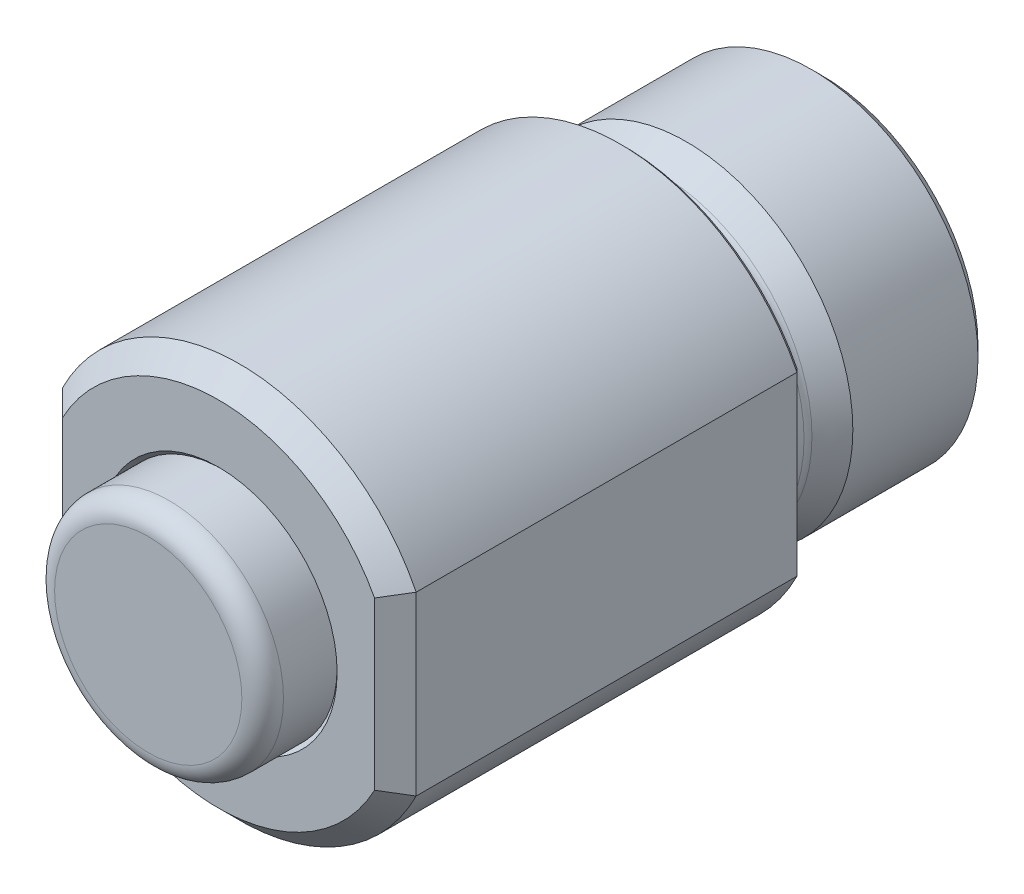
ISO-10303-21;
HEADER;
FILE_DESCRIPTION(('STEP AP214'),'2;1');
FILE_NAME('part.step','',(''),(''),'','','');
FILE_SCHEMA(('AUTOMOTIVE_DESIGN { 1 0 10303 214 1 1 1 1 }'));
ENDSEC;
DATA;
#1=APPLICATION_CONTEXT('core data for automotive mechanical design processes');
#2=APPLICATION_PROTOCOL_DEFINITION('international standard','automotive_design',2000,#1);
#3=PRODUCT_CONTEXT('',#1,'mechanical');
#4=PRODUCT('Part','Part','',(#3));
#5=PRODUCT_RELATED_PRODUCT_CATEGORY('part','',(#4));
#6=PRODUCT_DEFINITION_FORMATION('','',#4);
#7=PRODUCT_DEFINITION_CONTEXT('part definition',#1,'design');
#8=PRODUCT_DEFINITION('design','',#6,#7);
#9=PRODUCT_DEFINITION_SHAPE('','',#8);
#10=(LENGTH_UNIT() NAMED_UNIT(*) SI_UNIT(.MILLI.,.METRE.));
#11=(NAMED_UNIT(*) PLANE_ANGLE_UNIT() SI_UNIT($,.RADIAN.));
#12=(NAMED_UNIT(*) SI_UNIT($,.STERADIAN.) SOLID_ANGLE_UNIT());
#13=UNCERTAINTY_MEASURE_WITH_UNIT(LENGTH_MEASURE(1.E-05),#10,'distance_accuracy_value','');
#14=(GEOMETRIC_REPRESENTATION_CONTEXT(3) GLOBAL_UNCERTAINTY_ASSIGNED_CONTEXT((#13)) GLOBAL_UNIT_ASSIGNED_CONTEXT((#10,
#11,#12)) REPRESENTATION_CONTEXT('',''));
#15=CARTESIAN_POINT('',(0.,0.,0.));
#16=DIRECTION('',(0.,0.,1.));
#17=DIRECTION('',(1.,0.,0.));
#18=AXIS2_PLACEMENT_3D('',#15,#16,#17);
#19=CARTESIAN_POINT('',(0.,0.,10.8779491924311));
#20=DIRECTION('',(0.,0.,-1.));
#21=DIRECTION('',(-1.,0.,0.));
#22=AXIS2_PLACEMENT_3D('',#19,#20,#21);
#23=CYLINDRICAL_SURFACE('',#22,5.5);
#24=CARTESIAN_POINT('',(0.,0.,19.3));
#25=DIRECTION('',(0.,0.,1.));
#26=DIRECTION('',(1.,0.,0.));
#27=AXIS2_PLACEMENT_3D('',#24,#25,#26);
#28=CIRCLE('',#27,5.5);
#29=CARTESIAN_POINT('',(5.5,0.,19.3));
#30=VERTEX_POINT('',#29);
#31=EDGE_CURVE('E196',#30,#30,#28,.F.);
#32=ORIENTED_EDGE('',*,*,#31,.F.);
#33=EDGE_LOOP('',(#32));
#34=FACE_BOUND('',#33,.T.);
#35=CARTESIAN_POINT('',(0.,0.,21.8779491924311));
#36=DIRECTION('',(0.,0.,1.));
#37=DIRECTION('',(1.,0.,0.));
#38=AXIS2_PLACEMENT_3D('',#35,#36,#37);
#39=CIRCLE('',#38,5.5);
#40=CARTESIAN_POINT('',(5.5,0.,21.8779491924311));
#41=VERTEX_POINT('',#40);
#42=EDGE_CURVE('E194',#41,#41,#39,.F.);
#43=ORIENTED_EDGE('',*,*,#42,.T.);
#44=EDGE_LOOP('',(#43));
#45=FACE_BOUND('',#44,.T.);
#46=ADVANCED_FACE('F14',(#34,#45),#23,.T.);
#47=CARTESIAN_POINT('',(0.,3.,22.8779491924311));
#48=DIRECTION('',(0.,0.,1.));
#49=DIRECTION('',(1.,0.,0.));
#50=AXIS2_PLACEMENT_3D('',#47,#48,#49);
#51=PLANE('',#50);
#52=CARTESIAN_POINT('',(0.,0.,22.8779491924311));
#53=DIRECTION('',(0.,0.,1.));
#54=DIRECTION('',(1.,0.,0.));
#55=AXIS2_PLACEMENT_3D('',#52,#53,#54);
#56=CIRCLE('',#55,4.5);
#57=CARTESIAN_POINT('',(4.5,0.,22.8779491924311));
#58=VERTEX_POINT('',#57);
#59=EDGE_CURVE('E199',#58,#58,#56,.T.);
#60=ORIENTED_EDGE('',*,*,#59,.T.);
#61=EDGE_LOOP('',(#60));
#62=FACE_BOUND('',#61,.T.);
#63=ADVANCED_FACE('F367',(#62),#51,.T.);
#64=CARTESIAN_POINT('',(0.,0.,21.8779491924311));
#65=DIRECTION('',(0.,0.,1.));
#66=DIRECTION('',(1.,0.,0.));
#67=AXIS2_PLACEMENT_3D('',#64,#65,#66);
#68=TOROIDAL_SURFACE('',#67,4.5,1.);
#69=ORIENTED_EDGE('',*,*,#59,.F.);
#70=EDGE_LOOP('',(#69));
#71=FACE_BOUND('',#70,.T.);
#72=ORIENTED_EDGE('',*,*,#42,.F.);
#73=EDGE_LOOP('',(#72));
#74=FACE_BOUND('',#73,.T.);
#75=ADVANCED_FACE('F357',(#71,#74),#68,.T.);
#76=CARTESIAN_POINT('',(0.,0.,-7.83132896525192));
#77=DIRECTION('',(0.,0.,-1.));
#78=DIRECTION('',(-1.,0.,0.));
#79=AXIS2_PLACEMENT_3D('',#76,#77,#78);
#80=PLANE('',#79);
#81=CARTESIAN_POINT('',(0.,0.,-7.83132896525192));
#82=DIRECTION('',(0.,0.,-1.));
#83=DIRECTION('',(-1.,0.,0.));
#84=AXIS2_PLACEMENT_3D('',#81,#82,#83);
#85=CIRCLE('',#84,3.25);
#86=CARTESIAN_POINT('',(-3.25,0.,-7.83132896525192));
#87=VERTEX_POINT('',#86);
#88=EDGE_CURVE('E9',#87,#87,#85,.F.);
#89=ORIENTED_EDGE('',*,*,#88,.T.);
#90=EDGE_LOOP('',(#89));
#91=FACE_BOUND('',#90,.T.);
#92=CARTESIAN_POINT('',(0.,0.,-7.83132896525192));
#93=DIRECTION('',(0.,0.,-1.));
#94=DIRECTION('',(-1.,0.,0.));
#95=AXIS2_PLACEMENT_3D('',#92,#93,#94);
#96=CIRCLE('',#95,4.09337635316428);
#97=CARTESIAN_POINT('',(-4.09337635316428,0.,-7.83132896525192));
#98=VERTEX_POINT('',#97);
#99=EDGE_CURVE('E191',#98,#98,#96,.T.);
#100=ORIENTED_EDGE('',*,*,#99,.T.);
#101=EDGE_LOOP('',(#100));
#102=FACE_BOUND('',#101,.T.);
#103=ADVANCED_FACE('F350',(#91,#102),#80,.T.);
#104=CARTESIAN_POINT('',(0.,0.,-8.5));
#105=DIRECTION('',(0.,0.,1.));
#106=DIRECTION('',(1.,0.,0.));
#107=AXIS2_PLACEMENT_3D('',#104,#105,#106);
#108=CONICAL_SURFACE('',#107,3.85,0.34906585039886);
#109=ORIENTED_EDGE('',*,*,#99,.F.);
#110=EDGE_LOOP('',(#109));
#111=FACE_BOUND('',#110,.T.);
#112=CARTESIAN_POINT('',(0.,0.,-8.5));
#113=DIRECTION('',(0.,0.,-1.));
#114=DIRECTION('',(-1.,0.,0.));
#115=AXIS2_PLACEMENT_3D('',#112,#113,#114);
#116=CIRCLE('',#115,3.85);
#117=CARTESIAN_POINT('',(-3.85,0.,-8.5));
#118=VERTEX_POINT('',#117);
#119=EDGE_CURVE('E177',#118,#118,#116,.T.);
#120=ORIENTED_EDGE('',*,*,#119,.T.);
#121=EDGE_LOOP('',(#120));
#122=FACE_BOUND('',#121,.T.);
#123=ADVANCED_FACE('F356',(#111,#122),#108,.F.);
#124=CARTESIAN_POINT('',(0.,3.85,-8.5));
#125=DIRECTION('',(0.,0.,-1.));
#126=DIRECTION('',(-1.,0.,0.));
#127=AXIS2_PLACEMENT_3D('',#124,#125,#126);
#128=PLANE('',#127);
#129=ORIENTED_EDGE('',*,*,#119,.F.);
#130=EDGE_LOOP('',(#129));
#131=FACE_BOUND('',#130,.T.);
#132=CARTESIAN_POINT('',(0.,0.,-8.5));
#133=DIRECTION('',(0.,0.,-1.));
#134=DIRECTION('',(-1.,0.,0.));
#135=AXIS2_PLACEMENT_3D('',#132,#133,#134);
#136=CIRCLE('',#135,3.);
#137=CARTESIAN_POINT('',(-3.,0.,-8.5));
#138=VERTEX_POINT('',#137);
#139=EDGE_CURVE('E180',#138,#138,#136,.T.);
#140=ORIENTED_EDGE('',*,*,#139,.T.);
#141=EDGE_LOOP('',(#140));
#142=FACE_BOUND('',#141,.T.);
#143=ADVANCED_FACE('F364',(#131,#142),#128,.F.);
#144=CARTESIAN_POINT('',(0.,0.,-3.5));
#145=DIRECTION('',(0.,0.,-1.));
#146=DIRECTION('',(-1.,0.,0.));
#147=AXIS2_PLACEMENT_3D('',#144,#145,#146);
#148=CYLINDRICAL_SURFACE('',#147,3.);
#149=CARTESIAN_POINT('',(0.,0.,-9.));
#150=DIRECTION('',(0.,0.,1.));
#151=DIRECTION('',(1.,0.,0.));
#152=AXIS2_PLACEMENT_3D('',#149,#150,#151);
#153=CIRCLE('',#152,3.);
#154=CARTESIAN_POINT('',(3.,0.,-9.));
#155=VERTEX_POINT('',#154);
#156=EDGE_CURVE('E174',#155,#155,#153,.F.);
#157=ORIENTED_EDGE('',*,*,#156,.T.);
#158=EDGE_LOOP('',(#157));
#159=FACE_BOUND('',#158,.T.);
#160=ORIENTED_EDGE('',*,*,#139,.F.);
#161=EDGE_LOOP('',(#160));
#162=FACE_BOUND('',#161,.T.);
#163=ADVANCED_FACE('F522',(#159,#162),#148,.F.);
#164=CARTESIAN_POINT('',(0.,0.,-9.));
#165=DIRECTION('',(0.,0.,-1.));
#166=DIRECTION('',(-1.,0.,0.));
#167=AXIS2_PLACEMENT_3D('',#164,#165,#166);
#168=CONICAL_SURFACE('',#167,3.,0.785398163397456);
#169=CARTESIAN_POINT('',(0.,0.,-9.5));
#170=DIRECTION('',(0.,0.,1.));
#171=DIRECTION('',(1.,0.,0.));
#172=AXIS2_PLACEMENT_3D('',#169,#170,#171);
#173=CIRCLE('',#172,3.5);
#174=CARTESIAN_POINT('',(3.5,0.,-9.5));
#175=VERTEX_POINT('',#174);
#176=EDGE_CURVE('E171',#175,#175,#173,.T.);
#177=ORIENTED_EDGE('',*,*,#176,.F.);
#178=EDGE_LOOP('',(#177));
#179=FACE_BOUND('',#178,.T.);
#180=ORIENTED_EDGE('',*,*,#156,.F.);
#181=EDGE_LOOP('',(#180));
#182=FACE_BOUND('',#181,.T.);
#183=ADVANCED_FACE('F325',(#179,#182),#168,.F.);
#184=CARTESIAN_POINT('',(0.,8.,-9.5));
#185=DIRECTION('',(0.,0.,1.));
#186=DIRECTION('',(1.,0.,0.));
#187=AXIS2_PLACEMENT_3D('',#184,#185,#186);
#188=PLANE('',#187);
#189=CARTESIAN_POINT('',(0.,0.,-9.5));
#190=DIRECTION('',(0.,0.,1.));
#191=DIRECTION('',(1.,0.,0.));
#192=AXIS2_PLACEMENT_3D('',#189,#190,#191);
#193=CIRCLE('',#192,7.5);
#194=CARTESIAN_POINT('',(7.5,0.,-9.5));
#195=VERTEX_POINT('',#194);
#196=EDGE_CURVE('E165',#195,#195,#193,.F.);
#197=ORIENTED_EDGE('',*,*,#196,.T.);
#198=EDGE_LOOP('',(#197));
#199=FACE_BOUND('',#198,.T.);
#200=ORIENTED_EDGE('',*,*,#176,.T.);
#201=EDGE_LOOP('',(#200));
#202=FACE_BOUND('',#201,.T.);
#203=ADVANCED_FACE('F294',(#199,#202),#188,.F.);
#204=CARTESIAN_POINT('',(0.,0.,-9.));
#205=DIRECTION('',(0.,0.,1.));
#206=DIRECTION('',(1.,0.,0.));
#207=AXIS2_PLACEMENT_3D('',#204,#205,#206);
#208=CONICAL_SURFACE('',#207,8.,0.785398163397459);
#209=ORIENTED_EDGE('',*,*,#196,.F.);
#210=EDGE_LOOP('',(#209));
#211=FACE_BOUND('',#210,.T.);
#212=CARTESIAN_POINT('',(0.,0.,-9.));
#213=DIRECTION('',(0.,0.,1.));
#214=DIRECTION('',(1.,0.,0.));
#215=AXIS2_PLACEMENT_3D('',#212,#213,#214);
#216=CIRCLE('',#215,8.);
#217=CARTESIAN_POINT('',(8.,0.,-9.));
#218=VERTEX_POINT('',#217);
#219=EDGE_CURVE('E168',#218,#218,#216,.T.);
#220=ORIENTED_EDGE('',*,*,#219,.F.);
#221=EDGE_LOOP('',(#220));
#222=FACE_BOUND('',#221,.T.);
#223=ADVANCED_FACE('F316',(#211,#222),#208,.T.);
#224=CARTESIAN_POINT('',(0.,0.,19.0254858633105));
#225=DIRECTION('',(0.,0.,1.));
#226=DIRECTION('',(1.,0.,0.));
#227=AXIS2_PLACEMENT_3D('',#224,#225,#226);
#228=CYLINDRICAL_SURFACE('',#227,8.);
#229=ORIENTED_EDGE('',*,*,#219,.T.);
#230=EDGE_LOOP('',(#229));
#231=FACE_BOUND('',#230,.T.);
#232=CARTESIAN_POINT('',(0.,0.,-2.98564064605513));
#233=DIRECTION('',(0.,0.,-1.));
#234=DIRECTION('',(-1.,0.,0.));
#235=AXIS2_PLACEMENT_3D('',#232,#233,#234);
#236=CIRCLE('',#235,8.);
#237=CARTESIAN_POINT('',(-8.,0.,-2.98564064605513));
#238=VERTEX_POINT('',#237);
#239=EDGE_CURVE('E183',#238,#238,#236,.T.);
#240=ORIENTED_EDGE('',*,*,#239,.T.);
#241=EDGE_LOOP('',(#240));
#242=FACE_BOUND('',#241,.T.);
#243=ADVANCED_FACE('F305',(#231,#242),#228,.T.);
#244=CARTESIAN_POINT('',(0.,0.,-2.98564064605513));
#245=DIRECTION('',(0.,0.,-1.));
#246=DIRECTION('',(-1.,0.,0.));
#247=AXIS2_PLACEMENT_3D('',#244,#245,#246);
#248=CONICAL_SURFACE('',#247,8.,0.523598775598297);
#249=CARTESIAN_POINT('',(0.,0.,-1.73923048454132));
#250=DIRECTION('',(0.,0.,-1.));
#251=DIRECTION('',(-1.,0.,0.));
#252=AXIS2_PLACEMENT_3D('',#249,#250,#251);
#253=CIRCLE('',#252,7.28038475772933);
#254=CARTESIAN_POINT('',(-7.28038475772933,0.,-1.73923048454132));
#255=VERTEX_POINT('',#254);
#256=EDGE_CURVE('E257',#255,#255,#253,.T.);
#257=ORIENTED_EDGE('',*,*,#256,.T.);
#258=EDGE_LOOP('',(#257));
#259=FACE_BOUND('',#258,.T.);
#260=ORIENTED_EDGE('',*,*,#239,.F.);
#261=EDGE_LOOP('',(#260));
#262=FACE_BOUND('',#261,.T.);
#263=ADVANCED_FACE('F297',(#259,#262),#248,.T.);
#264=CARTESIAN_POINT('',(0.,0.,-1.43923048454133));
#265=DIRECTION('',(0.,0.,-1.));
#266=DIRECTION('',(-1.,0.,0.));
#267=AXIS2_PLACEMENT_3D('',#264,#265,#266);
#268=TOROIDAL_SURFACE('',#267,7.8,0.6);
#269=CARTESIAN_POINT('',(0.,0.,-1.43923048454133));
#270=DIRECTION('',(0.,0.,-1.));
#271=DIRECTION('',(-1.,0.,0.));
#272=AXIS2_PLACEMENT_3D('',#269,#270,#271);
#273=CIRCLE('',#272,7.2);
#274=CARTESIAN_POINT('',(-7.2,0.,-1.43923048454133));
#275=VERTEX_POINT('',#274);
#276=EDGE_CURVE('E263',#275,#275,#273,.F.);
#277=ORIENTED_EDGE('',*,*,#276,.F.);
#278=EDGE_LOOP('',(#277));
#279=FACE_BOUND('',#278,.T.);
#280=ORIENTED_EDGE('',*,*,#256,.F.);
#281=EDGE_LOOP('',(#280));
#282=FACE_BOUND('',#281,.T.);
#283=ADVANCED_FACE('F236',(#279,#282),#268,.F.);
#284=CARTESIAN_POINT('',(0.,0.,-3.5));
#285=DIRECTION('',(0.,0.,-1.));
#286=DIRECTION('',(-1.,0.,0.));
#287=AXIS2_PLACEMENT_3D('',#284,#285,#286);
#288=CYLINDRICAL_SURFACE('',#287,7.2);
#289=ORIENTED_EDGE('',*,*,#276,.T.);
#290=EDGE_LOOP('',(#289));
#291=FACE_BOUND('',#290,.T.);
#292=CARTESIAN_POINT('',(0.,0.,-0.6));
#293=DIRECTION('',(0.,0.,1.));
#294=DIRECTION('',(1.,0.,0.));
#295=AXIS2_PLACEMENT_3D('',#292,#293,#294);
#296=CIRCLE('',#295,7.2);
#297=CARTESIAN_POINT('',(7.2,0.,-0.6));
#298=VERTEX_POINT('',#297);
#299=EDGE_CURVE('E260',#298,#298,#296,.F.);
#300=ORIENTED_EDGE('',*,*,#299,.T.);
#301=EDGE_LOOP('',(#300));
#302=FACE_BOUND('',#301,.T.);
#303=ADVANCED_FACE('F285',(#291,#302),#288,.T.);
#304=CARTESIAN_POINT('',(0.,0.,-0.6));
#305=DIRECTION('',(0.,0.,1.));
#306=DIRECTION('',(1.,0.,0.));
#307=AXIS2_PLACEMENT_3D('',#304,#305,#306);
#308=TOROIDAL_SURFACE('',#307,7.8,0.6);
#309=CARTESIAN_POINT('',(0.,0.,0.));
#310=DIRECTION('',(0.,0.,1.));
#311=DIRECTION('',(1.,0.,0.));
#312=AXIS2_PLACEMENT_3D('',#309,#310,#311);
#313=CIRCLE('',#312,7.8);
#314=CARTESIAN_POINT('',(7.8,0.,0.));
#315=VERTEX_POINT('',#314);
#316=EDGE_CURVE('E195',#315,#315,#313,.T.);
#317=ORIENTED_EDGE('',*,*,#316,.F.);
#318=EDGE_LOOP('',(#317));
#319=FACE_BOUND('',#318,.T.);
#320=ORIENTED_EDGE('',*,*,#299,.F.);
#321=EDGE_LOOP('',(#320));
#322=FACE_BOUND('',#321,.T.);
#323=ADVANCED_FACE('F282',(#319,#322),#308,.F.);
#324=CARTESIAN_POINT('',(0.,8.,0.));
#325=DIRECTION('',(0.,0.,1.));
#326=DIRECTION('',(1.,0.,0.));
#327=AXIS2_PLACEMENT_3D('',#324,#325,#326);
#328=PLANE('',#327);
#329=ORIENTED_EDGE('',*,*,#316,.T.);
#330=EDGE_LOOP('',(#329));
#331=FACE_BOUND('',#330,.T.);
#332=CARTESIAN_POINT('',(0.,0.,0.));
#333=DIRECTION('',(0.,0.,1.));
#334=DIRECTION('',(1.,0.,0.));
#335=AXIS2_PLACEMENT_3D('',#332,#333,#334);
#336=CIRCLE('',#335,9.3);
#337=CARTESIAN_POINT('',(8.3,-4.19523539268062,0.));
#338=VERTEX_POINT('',#337);
#339=CARTESIAN_POINT('',(-8.3,-4.19523539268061,0.));
#340=VERTEX_POINT('',#339);
#341=EDGE_CURVE('E159',#338,#340,#336,.F.);
#342=ORIENTED_EDGE('',*,*,#341,.T.);
#343=DIRECTION('',(0.,1.,0.));
#344=VECTOR('',#343,1.);
#345=CARTESIAN_POINT('',(-8.3,8.,0.));
#346=LINE('',#345,#344);
#347=CARTESIAN_POINT('',(-8.3,4.19523539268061,0.));
#348=VERTEX_POINT('',#347);
#349=EDGE_CURVE('E116',#340,#348,#346,.T.);
#350=ORIENTED_EDGE('',*,*,#349,.T.);
#351=CARTESIAN_POINT('',(8.3,4.19523539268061,0.));
#352=VERTEX_POINT('',#351);
#353=EDGE_CURVE('E160',#348,#352,#336,.F.);
#354=ORIENTED_EDGE('',*,*,#353,.T.);
#355=DIRECTION('',(0.,-1.,0.));
#356=VECTOR('',#355,1.);
#357=CARTESIAN_POINT('',(8.3,8.,0.));
#358=LINE('',#357,#356);
#359=EDGE_CURVE('E157',#352,#338,#358,.T.);
#360=ORIENTED_EDGE('',*,*,#359,.T.);
#361=EDGE_LOOP('',(#342,#350,#354,#360));
#362=FACE_BOUND('',#361,.T.);
#363=ADVANCED_FACE('F284',(#331,#362),#328,.F.);
#364=CARTESIAN_POINT('',(8.5,-9.5,0.2));
#365=DIRECTION('',(-0.707106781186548,0.,0.707106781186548));
#366=DIRECTION('',(0.707106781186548,0.,0.707106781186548));
#367=AXIS2_PLACEMENT_3D('',#364,#365,#366);
#368=PLANE('',#367);
#369=CARTESIAN_POINT('',(8.3,-4.19523539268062,0.));
#370=CARTESIAN_POINT('',(8.33332821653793,-4.2031794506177,0.0333282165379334));
#371=CARTESIAN_POINT('',(8.36665899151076,-4.21110192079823,0.0666589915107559));
#372=CARTESIAN_POINT('',(8.43332565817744,-4.22690368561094,0.133325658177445));
#373=CARTESIAN_POINT('',(8.46666154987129,-4.2347829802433,0.16666154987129));
#374=CARTESIAN_POINT('',(8.5,-4.2426406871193,0.2));
#375=B_SPLINE_CURVE_WITH_KNOTS('',3,(#369,#370,#371,#372,#373,#374),.UNSPECIFIED.,.F.,.F.,(4,2,
4),(0.,0.143393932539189,0.286787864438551),.UNSPECIFIED.);
#376=CARTESIAN_POINT('',(8.5,-4.24264068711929,0.2));
#377=VERTEX_POINT('',#376);
#378=EDGE_CURVE('E101',#338,#377,#375,.T.);
#379=ORIENTED_EDGE('',*,*,#378,.F.);
#380=ORIENTED_EDGE('',*,*,#359,.F.);
#381=CARTESIAN_POINT('',(8.5,4.24264068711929,0.2));
#382=CARTESIAN_POINT('',(8.46666154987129,4.23478298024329,0.166661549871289));
#383=CARTESIAN_POINT('',(8.43332565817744,4.22690368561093,0.133325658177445));
#384=CARTESIAN_POINT('',(8.36665899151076,4.21110192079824,0.0666589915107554));
#385=CARTESIAN_POINT('',(8.33332821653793,4.20317945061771,0.033328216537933));
#386=CARTESIAN_POINT('',(8.3,4.19523539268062,0.));
#387=B_SPLINE_CURVE_WITH_KNOTS('',3,(#381,#382,#383,#384,#385,#386),.UNSPECIFIED.,.F.,.F.,(4,2,
4),(0.,0.143393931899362,0.28678786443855),.UNSPECIFIED.);
#388=CARTESIAN_POINT('',(8.5,4.24264068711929,0.2));
#389=VERTEX_POINT('',#388);
#390=EDGE_CURVE('E150',#389,#352,#387,.T.);
#391=ORIENTED_EDGE('',*,*,#390,.F.);
#392=DIRECTION('',(0.,1.,0.));
#393=VECTOR('',#392,1.);
#394=CARTESIAN_POINT('',(8.5,-9.5,0.2));
#395=LINE('',#394,#393);
#396=EDGE_CURVE('E117',#377,#389,#395,.T.);
#397=ORIENTED_EDGE('',*,*,#396,.F.);
#398=EDGE_LOOP('',(#379,#380,#391,#397));
#399=FACE_BOUND('',#398,.T.);
#400=ADVANCED_FACE('F140',(#399),#368,.F.);
#401=CARTESIAN_POINT('',(0.,0.,0.2));
#402=DIRECTION('',(0.,0.,1.));
#403=DIRECTION('',(1.,0.,0.));
#404=AXIS2_PLACEMENT_3D('',#401,#402,#403);
#405=CONICAL_SURFACE('',#404,9.5,0.785398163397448);
#406=CARTESIAN_POINT('',(0.,0.,0.2));
#407=DIRECTION('',(0.,0.,1.));
#408=DIRECTION('',(1.,0.,0.));
#409=AXIS2_PLACEMENT_3D('',#406,#407,#408);
#410=CIRCLE('',#409,9.5);
#411=CARTESIAN_POINT('',(-8.5,-4.24264068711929,0.2));
#412=VERTEX_POINT('',#411);
#413=EDGE_CURVE('E85',#412,#377,#410,.T.);
#414=ORIENTED_EDGE('',*,*,#413,.F.);
#415=CARTESIAN_POINT('',(-8.5,-4.24264068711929,0.2));
#416=CARTESIAN_POINT('',(-8.46666154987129,-4.2347829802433,0.166661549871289));
#417=CARTESIAN_POINT('',(-8.43332565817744,-4.22690368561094,0.133325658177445));
#418=CARTESIAN_POINT('',(-8.36665899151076,-4.21110192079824,0.0666589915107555));
#419=CARTESIAN_POINT('',(-8.33332821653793,-4.20317945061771,0.0333282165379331));
#420=CARTESIAN_POINT('',(-8.3,-4.19523539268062,0.));
#421=B_SPLINE_CURVE_WITH_KNOTS('',3,(#415,#416,#417,#418,#419,#420),.UNSPECIFIED.,.F.,.F.,(4,2,
4),(0.,0.143393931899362,0.28678786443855),.UNSPECIFIED.);
#422=EDGE_CURVE('E107',#412,#340,#421,.T.);
#423=ORIENTED_EDGE('',*,*,#422,.T.);
#424=ORIENTED_EDGE('',*,*,#341,.F.);
#425=ORIENTED_EDGE('',*,*,#378,.T.);
#426=EDGE_LOOP('',(#414,#423,#424,#425));
#427=FACE_BOUND('',#426,.T.);
#428=ADVANCED_FACE('F105',(#427),#405,.T.);
#429=CARTESIAN_POINT('',(-8.3,8.,0.));
#430=DIRECTION('',(0.707106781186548,0.,0.707106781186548));
#431=DIRECTION('',(0.707106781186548,0.,-0.707106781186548));
#432=AXIS2_PLACEMENT_3D('',#429,#430,#431);
#433=PLANE('',#432);
#434=ORIENTED_EDGE('',*,*,#422,.F.);
#435=DIRECTION('',(0.,-1.,0.));
#436=VECTOR('',#435,1.);
#437=CARTESIAN_POINT('',(-8.5,-9.5,0.2));
#438=LINE('',#437,#436);
#439=CARTESIAN_POINT('',(-8.5,4.24264068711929,0.2));
#440=VERTEX_POINT('',#439);
#441=EDGE_CURVE('E96',#440,#412,#438,.T.);
#442=ORIENTED_EDGE('',*,*,#441,.F.);
#443=CARTESIAN_POINT('',(-8.3,4.19523539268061,0.));
#444=CARTESIAN_POINT('',(-8.33332821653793,4.2031794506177,0.0333282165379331));
#445=CARTESIAN_POINT('',(-8.36665899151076,4.21110192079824,0.0666589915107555));
#446=CARTESIAN_POINT('',(-8.43332565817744,4.22690368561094,0.133325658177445));
#447=CARTESIAN_POINT('',(-8.46666154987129,4.2347829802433,0.166661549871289));
#448=CARTESIAN_POINT('',(-8.5,4.2426406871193,0.2));
#449=B_SPLINE_CURVE_WITH_KNOTS('',3,(#443,#444,#445,#446,#447,#448),.UNSPECIFIED.,.F.,.F.,(4,2,
4),(0.,0.143393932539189,0.286787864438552),.UNSPECIFIED.);
#450=EDGE_CURVE('E102',#348,#440,#449,.T.);
#451=ORIENTED_EDGE('',*,*,#450,.F.);
#452=ORIENTED_EDGE('',*,*,#349,.F.);
#453=EDGE_LOOP('',(#434,#442,#451,#452));
#454=FACE_BOUND('',#453,.T.);
#455=ADVANCED_FACE('F114',(#454),#433,.F.);
#456=ORIENTED_EDGE('',*,*,#353,.F.);
#457=ORIENTED_EDGE('',*,*,#450,.T.);
#458=EDGE_CURVE('E110',#389,#440,#410,.T.);
#459=ORIENTED_EDGE('',*,*,#458,.F.);
#460=ORIENTED_EDGE('',*,*,#390,.T.);
#461=EDGE_LOOP('',(#456,#457,#459,#460));
#462=FACE_BOUND('',#461,.T.);
#463=ADVANCED_FACE('F139',(#462),#405,.T.);
#464=CARTESIAN_POINT('',(8.5,-9.5,0.));
#465=DIRECTION('',(-1.,0.,0.));
#466=DIRECTION('',(0.,-1.,0.));
#467=AXIS2_PLACEMENT_3D('',#464,#465,#466);
#468=PLANE('',#467);
#469=DIRECTION('',(0.,0.,1.));
#470=VECTOR('',#469,1.);
#471=CARTESIAN_POINT('',(8.5,4.24264068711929,19.0254858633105));
#472=LINE('',#471,#470);
#473=CARTESIAN_POINT('',(8.5,4.24264068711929,18.5));
#474=VERTEX_POINT('',#473);
#475=EDGE_CURVE('E188',#474,#389,#472,.F.);
#476=ORIENTED_EDGE('',*,*,#475,.F.);
#477=DIRECTION('',(0.,-1.,0.));
#478=VECTOR('',#477,1.);
#479=CARTESIAN_POINT('',(8.5,-9.5,18.5));
#480=LINE('',#479,#478);
#481=CARTESIAN_POINT('',(8.5,-4.24264068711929,18.5));
#482=VERTEX_POINT('',#481);
#483=EDGE_CURVE('E36',#474,#482,#480,.T.);
#484=ORIENTED_EDGE('',*,*,#483,.T.);
#485=DIRECTION('',(0.,0.,1.));
#486=VECTOR('',#485,1.);
#487=CARTESIAN_POINT('',(8.5,-4.24264068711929,19.0254858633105));
#488=LINE('',#487,#486);
#489=EDGE_CURVE('E186',#377,#482,#488,.T.);
#490=ORIENTED_EDGE('',*,*,#489,.F.);
#491=ORIENTED_EDGE('',*,*,#396,.T.);
#492=EDGE_LOOP('',(#476,#484,#490,#491));
#493=FACE_BOUND('',#492,.T.);
#494=ADVANCED_FACE('F308',(#493),#468,.F.);
#495=CARTESIAN_POINT('',(0.,0.,19.0254858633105));
#496=DIRECTION('',(0.,0.,1.));
#497=DIRECTION('',(1.,0.,0.));
#498=AXIS2_PLACEMENT_3D('',#495,#496,#497);
#499=CYLINDRICAL_SURFACE('',#498,9.5);
#500=ORIENTED_EDGE('',*,*,#489,.T.);
#501=CARTESIAN_POINT('',(0.,0.,18.5));
#502=DIRECTION('',(0.,0.,-1.));
#503=DIRECTION('',(-1.,0.,0.));
#504=AXIS2_PLACEMENT_3D('',#501,#502,#503);
#505=CIRCLE('',#504,9.5);
#506=CARTESIAN_POINT('',(-8.5,-4.24264068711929,18.5));
#507=VERTEX_POINT('',#506);
#508=EDGE_CURVE('E87',#482,#507,#505,.T.);
#509=ORIENTED_EDGE('',*,*,#508,.T.);
#510=DIRECTION('',(0.,0.,1.));
#511=VECTOR('',#510,1.);
#512=CARTESIAN_POINT('',(-8.5,-4.24264068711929,19.0254858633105));
#513=LINE('',#512,#511);
#514=EDGE_CURVE('E81',#507,#412,#513,.F.);
#515=ORIENTED_EDGE('',*,*,#514,.T.);
#516=ORIENTED_EDGE('',*,*,#413,.T.);
#517=EDGE_LOOP('',(#500,#509,#515,#516));
#518=FACE_BOUND('',#517,.T.);
#519=ADVANCED_FACE('F83',(#518),#499,.T.);
#520=CARTESIAN_POINT('',(-8.5,-9.5,0.));
#521=DIRECTION('',(1.,0.,0.));
#522=DIRECTION('',(0.,1.,0.));
#523=AXIS2_PLACEMENT_3D('',#520,#521,#522);
#524=PLANE('',#523);
#525=ORIENTED_EDGE('',*,*,#514,.F.);
#526=DIRECTION('',(0.,1.,0.));
#527=VECTOR('',#526,1.);
#528=CARTESIAN_POINT('',(-8.5,-9.5,18.5));
#529=LINE('',#528,#527);
#530=CARTESIAN_POINT('',(-8.5,4.24264068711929,18.5));
#531=VERTEX_POINT('',#530);
#532=EDGE_CURVE('E120',#507,#531,#529,.T.);
#533=ORIENTED_EDGE('',*,*,#532,.T.);
#534=DIRECTION('',(0.,0.,1.));
#535=VECTOR('',#534,1.);
#536=CARTESIAN_POINT('',(-8.5,4.24264068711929,19.0254858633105));
#537=LINE('',#536,#535);
#538=EDGE_CURVE('E91',#440,#531,#537,.T.);
#539=ORIENTED_EDGE('',*,*,#538,.F.);
#540=ORIENTED_EDGE('',*,*,#441,.T.);
#541=EDGE_LOOP('',(#525,#533,#539,#540));
#542=FACE_BOUND('',#541,.T.);
#543=ADVANCED_FACE('F97',(#542),#524,.F.);
#544=ORIENTED_EDGE('',*,*,#538,.T.);
#545=CARTESIAN_POINT('',(0.,0.,18.5));
#546=DIRECTION('',(0.,0.,-1.));
#547=DIRECTION('',(-1.,0.,0.));
#548=AXIS2_PLACEMENT_3D('',#545,#546,#547);
#549=CIRCLE('',#548,9.5);
#550=EDGE_CURVE('E29',#531,#474,#549,.T.);
#551=ORIENTED_EDGE('',*,*,#550,.T.);
#552=ORIENTED_EDGE('',*,*,#475,.T.);
#553=ORIENTED_EDGE('',*,*,#458,.T.);
#554=EDGE_LOOP('',(#544,#551,#552,#553));
#555=FACE_BOUND('',#554,.T.);
#556=ADVANCED_FACE('F293',(#555),#499,.T.);
#557=CARTESIAN_POINT('',(7.5,0.,19.5));
#558=DIRECTION('',(-0.707106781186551,0.,-0.707106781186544));
#559=DIRECTION('',(-0.707106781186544,0.,0.707106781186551));
#560=AXIS2_PLACEMENT_3D('',#557,#558,#559);
#561=PLANE('',#560);
#562=CARTESIAN_POINT('',(7.5,4.00000000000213,19.5));
#563=CARTESIAN_POINT('',(7.66652645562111,4.0415962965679,19.3334735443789));
#564=CARTESIAN_POINT('',(7.83312304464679,4.08261450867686,19.1668769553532));
#565=CARTESIAN_POINT('',(8.16645637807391,4.1634947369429,18.8335436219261));
#566=CARTESIAN_POINT('',(8.33319312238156,4.20335675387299,18.6668068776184));
#567=CARTESIAN_POINT('',(8.5,4.24264068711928,18.5));
#568=B_SPLINE_CURVE_WITH_KNOTS('',3,(#562,#563,#564,#565,#566,#567),.UNSPECIFIED.,.F.,.F.,(4,2,
4),(0.,0.717441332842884,1.43488218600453),.UNSPECIFIED.);
#569=CARTESIAN_POINT('',(7.49999999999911,4.00000000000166,19.5));
#570=VERTEX_POINT('',#569);
#571=EDGE_CURVE('E215',#570,#474,#568,.T.);
#572=ORIENTED_EDGE('',*,*,#571,.F.);
#573=DIRECTION('',(0.,1.,0.));
#574=VECTOR('',#573,1.);
#575=CARTESIAN_POINT('',(7.5,0.,19.5));
#576=LINE('',#575,#574);
#577=CARTESIAN_POINT('',(7.5,-4.00000000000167,19.5));
#578=VERTEX_POINT('',#577);
#579=EDGE_CURVE('E601',#578,#570,#576,.T.);
#580=ORIENTED_EDGE('',*,*,#579,.F.);
#581=CARTESIAN_POINT('',(7.49999999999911,-4.00000000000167,19.5));
#582=CARTESIAN_POINT('',(7.66652645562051,-4.04159629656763,19.333473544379));
#583=CARTESIAN_POINT('',(7.8331230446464,-4.08261450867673,19.1668769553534));
#584=CARTESIAN_POINT('',(8.16645637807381,-4.16349473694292,18.8335436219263));
#585=CARTESIAN_POINT('',(8.33319312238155,-4.20335675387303,18.6668068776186));
#586=CARTESIAN_POINT('',(8.5,-4.24264068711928,18.5));
#587=B_SPLINE_CURVE_WITH_KNOTS('',3,(#581,#582,#583,#584,#585,#586),.UNSPECIFIED.,.F.,.F.,(4,2,
4),(0.,0.717441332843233,1.43488218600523),.UNSPECIFIED.);
#588=EDGE_CURVE('E92',#482,#578,#587,.F.);
#589=ORIENTED_EDGE('',*,*,#588,.F.);
#590=ORIENTED_EDGE('',*,*,#483,.F.);
#591=EDGE_LOOP('',(#572,#580,#589,#590));
#592=FACE_BOUND('',#591,.T.);
#593=ADVANCED_FACE('F241',(#592),#561,.F.);
#594=CARTESIAN_POINT('',(0.,0.,19.5));
#595=DIRECTION('',(0.,0.,-1.));
#596=DIRECTION('',(-1.,0.,0.));
#597=AXIS2_PLACEMENT_3D('',#594,#595,#596);
#598=CONICAL_SURFACE('',#597,8.5,0.785398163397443);
#599=ORIENTED_EDGE('',*,*,#588,.T.);
#600=CARTESIAN_POINT('',(0.,0.,19.5));
#601=DIRECTION('',(0.,0.,-1.));
#602=DIRECTION('',(-1.,0.,0.));
#603=AXIS2_PLACEMENT_3D('',#600,#601,#602);
#604=CIRCLE('',#603,8.5);
#605=CARTESIAN_POINT('',(-7.49999999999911,-4.00000000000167,19.5));
#606=VERTEX_POINT('',#605);
#607=EDGE_CURVE('E606',#606,#578,#604,.F.);
#608=ORIENTED_EDGE('',*,*,#607,.F.);
#609=CARTESIAN_POINT('',(-7.5,-4.00000000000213,19.5));
#610=CARTESIAN_POINT('',(-7.66652645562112,-4.04159629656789,19.3334735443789));
#611=CARTESIAN_POINT('',(-7.8331230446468,-4.08261450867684,19.1668769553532));
#612=CARTESIAN_POINT('',(-8.16645637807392,-4.16349473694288,18.8335436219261));
#613=CARTESIAN_POINT('',(-8.33319312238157,-4.20335675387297,18.6668068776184));
#614=CARTESIAN_POINT('',(-8.5,-4.24264068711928,18.5));
#615=B_SPLINE_CURVE_WITH_KNOTS('',3,(#609,#610,#611,#612,#613,#614),.UNSPECIFIED.,.F.,.F.,(4,2,
4),(0.,0.717441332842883,1.43488218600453),.UNSPECIFIED.);
#616=EDGE_CURVE('E209',#507,#606,#615,.F.);
#617=ORIENTED_EDGE('',*,*,#616,.F.);
#618=ORIENTED_EDGE('',*,*,#508,.F.);
#619=EDGE_LOOP('',(#599,#608,#617,#618));
#620=FACE_BOUND('',#619,.T.);
#621=ADVANCED_FACE('F235',(#620),#598,.T.);
#622=CARTESIAN_POINT('',(-8.5,-9.5,18.5));
#623=DIRECTION('',(0.707106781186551,0.,-0.707106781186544));
#624=DIRECTION('',(-0.707106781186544,0.,-0.707106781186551));
#625=AXIS2_PLACEMENT_3D('',#622,#623,#624);
#626=PLANE('',#625);
#627=ORIENTED_EDGE('',*,*,#616,.T.);
#628=DIRECTION('',(0.,-1.,0.));
#629=VECTOR('',#628,1.);
#630=CARTESIAN_POINT('',(-7.5,0.,19.5));
#631=LINE('',#630,#629);
#632=CARTESIAN_POINT('',(-7.49999999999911,4.00000000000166,19.5));
#633=VERTEX_POINT('',#632);
#634=EDGE_CURVE('E603',#633,#606,#631,.T.);
#635=ORIENTED_EDGE('',*,*,#634,.F.);
#636=CARTESIAN_POINT('',(-8.5,4.24264068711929,18.5));
#637=CARTESIAN_POINT('',(-8.33319312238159,4.20335675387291,18.6668068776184));
#638=CARTESIAN_POINT('',(-8.16645637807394,4.16349473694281,18.8335436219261));
#639=CARTESIAN_POINT('',(-7.83312304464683,4.08261450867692,19.1668769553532));
#640=CARTESIAN_POINT('',(-7.66652645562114,4.04159629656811,19.3334735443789));
#641=CARTESIAN_POINT('',(-7.5,4.00000000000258,19.5));
#642=B_SPLINE_CURVE_WITH_KNOTS('',3,(#636,#637,#638,#639,#640,#641),.UNSPECIFIED.,.F.,.F.,(4,2,
4),(0.,0.717440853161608,1.43488218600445),.UNSPECIFIED.);
#643=EDGE_CURVE('E206',#633,#531,#642,.F.);
#644=ORIENTED_EDGE('',*,*,#643,.T.);
#645=ORIENTED_EDGE('',*,*,#532,.F.);
#646=EDGE_LOOP('',(#627,#635,#644,#645));
#647=FACE_BOUND('',#646,.T.);
#648=ADVANCED_FACE('F232',(#647),#626,.F.);
#649=CARTESIAN_POINT('',(0.,0.,19.5));
#650=DIRECTION('',(0.,0.,-1.));
#651=DIRECTION('',(-1.,0.,0.));
#652=AXIS2_PLACEMENT_3D('',#649,#650,#651);
#653=CONICAL_SURFACE('',#652,8.5,0.785398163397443);
#654=ORIENTED_EDGE('',*,*,#571,.T.);
#655=ORIENTED_EDGE('',*,*,#550,.F.);
#656=ORIENTED_EDGE('',*,*,#643,.F.);
#657=CARTESIAN_POINT('',(0.,0.,19.5));
#658=DIRECTION('',(0.,0.,-1.));
#659=DIRECTION('',(-1.,0.,0.));
#660=AXIS2_PLACEMENT_3D('',#657,#658,#659);
#661=CIRCLE('',#660,8.5);
#662=EDGE_CURVE('E611',#570,#633,#661,.F.);
#663=ORIENTED_EDGE('',*,*,#662,.F.);
#664=EDGE_LOOP('',(#654,#655,#656,#663));
#665=FACE_BOUND('',#664,.T.);
#666=ADVANCED_FACE('F230',(#665),#653,.T.);
#667=CARTESIAN_POINT('',(0.,0.,19.5));
#668=DIRECTION('',(0.,0.,-1.));
#669=DIRECTION('',(-1.,0.,0.));
#670=AXIS2_PLACEMENT_3D('',#667,#668,#669);
#671=PLANE('',#670);
#672=ORIENTED_EDGE('',*,*,#662,.T.);
#673=ORIENTED_EDGE('',*,*,#634,.T.);
#674=ORIENTED_EDGE('',*,*,#607,.T.);
#675=ORIENTED_EDGE('',*,*,#579,.T.);
#676=EDGE_LOOP('',(#672,#673,#674,#675));
#677=FACE_BOUND('',#676,.T.);
#678=CARTESIAN_POINT('',(0.,0.,19.5));
#679=DIRECTION('',(0.,0.,-1.));
#680=DIRECTION('',(-1.,0.,0.));
#681=AXIS2_PLACEMENT_3D('',#678,#679,#680);
#682=CIRCLE('',#681,5.7);
#683=CARTESIAN_POINT('',(-5.7,0.,19.5));
#684=VERTEX_POINT('',#683);
#685=EDGE_CURVE('E111',#684,#684,#682,.T.);
#686=ORIENTED_EDGE('',*,*,#685,.T.);
#687=EDGE_LOOP('',(#686));
#688=FACE_BOUND('',#687,.T.);
#689=ADVANCED_FACE('F319',(#677,#688),#671,.F.);
#690=CARTESIAN_POINT('',(0.,0.,19.5));
#691=DIRECTION('',(0.,0.,1.));
#692=DIRECTION('',(1.,0.,0.));
#693=AXIS2_PLACEMENT_3D('',#690,#691,#692);
#694=CONICAL_SURFACE('',#693,5.7,0.785398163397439);
#695=ORIENTED_EDGE('',*,*,#31,.T.);
#696=EDGE_LOOP('',(#695));
#697=FACE_BOUND('',#696,.T.);
#698=ORIENTED_EDGE('',*,*,#685,.F.);
#699=EDGE_LOOP('',(#698));
#700=FACE_BOUND('',#699,.T.);
#701=ADVANCED_FACE('F326',(#697,#700),#694,.F.);
#702=CARTESIAN_POINT('',(0.,0.,-1.3));
#703=DIRECTION('',(0.,0.,-1.));
#704=DIRECTION('',(-1.,0.,0.));
#705=AXIS2_PLACEMENT_3D('',#702,#703,#704);
#706=CYLINDRICAL_SURFACE('',#705,2.75);
#707=CARTESIAN_POINT('',(0.,0.,-7.33132896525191));
#708=DIRECTION('',(0.,0.,-1.));
#709=DIRECTION('',(-1.,0.,0.));
#710=AXIS2_PLACEMENT_3D('',#707,#708,#709);
#711=CIRCLE('',#710,2.75);
#712=CARTESIAN_POINT('',(-2.75,0.,-7.33132896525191));
#713=VERTEX_POINT('',#712);
#714=EDGE_CURVE('E22',#713,#713,#711,.T.);
#715=ORIENTED_EDGE('',*,*,#714,.T.);
#716=EDGE_LOOP('',(#715));
#717=FACE_BOUND('',#716,.T.);
#718=CARTESIAN_POINT('',(0.,0.,-1.3));
#719=DIRECTION('',(0.,0.,-1.));
#720=DIRECTION('',(-1.,0.,0.));
#721=AXIS2_PLACEMENT_3D('',#718,#719,#720);
#722=CIRCLE('',#721,2.75);
#723=CARTESIAN_POINT('',(-2.75,0.,-1.3));
#724=VERTEX_POINT('',#723);
#725=EDGE_CURVE('E204',#724,#724,#722,.T.);
#726=ORIENTED_EDGE('',*,*,#725,.F.);
#727=EDGE_LOOP('',(#726));
#728=FACE_BOUND('',#727,.T.);
#729=ADVANCED_FACE('F270',(#717,#728),#706,.F.);
#730=CARTESIAN_POINT('',(0.,0.,-1.3));
#731=DIRECTION('',(0.,0.,-1.));
#732=DIRECTION('',(-1.,0.,0.));
#733=AXIS2_PLACEMENT_3D('',#730,#731,#732);
#734=PLANE('',#733);
#735=ORIENTED_EDGE('',*,*,#725,.T.);
#736=EDGE_LOOP('',(#735));
#737=FACE_BOUND('',#736,.T.);
#738=ADVANCED_FACE('F274',(#737),#734,.T.);
#739=CARTESIAN_POINT('',(0.,0.,-7.33132896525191));
#740=DIRECTION('',(0.,0.,-1.));
#741=DIRECTION('',(-1.,0.,0.));
#742=AXIS2_PLACEMENT_3D('',#739,#740,#741);
#743=CONICAL_SURFACE('',#742,2.75,0.785398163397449);
#744=ORIENTED_EDGE('',*,*,#88,.F.);
#745=EDGE_LOOP('',(#744));
#746=FACE_BOUND('',#745,.T.);
#747=ORIENTED_EDGE('',*,*,#714,.F.);
#748=EDGE_LOOP('',(#747));
#749=FACE_BOUND('',#748,.T.);
#750=ADVANCED_FACE('F16',(#746,#749),#743,.F.);
#751=CLOSED_SHELL('',(#46,#63,#75,#103,#123,#143,#163,#183,#203,#223,#243,#263,#283,#303,#323,
#363,#400,#428,#455,#463,#494,#519,#543,#556,#593,#621,#648,#666,#689,#701,#729,#738,#750));
#752=MANIFOLD_SOLID_BREP('B1',#751);
#753=ADVANCED_BREP_SHAPE_REPRESENTATION('',(#18,#752),#14);
#754=SHAPE_DEFINITION_REPRESENTATION(#9,#753);
ENDSEC;
END-ISO-10303-21;
